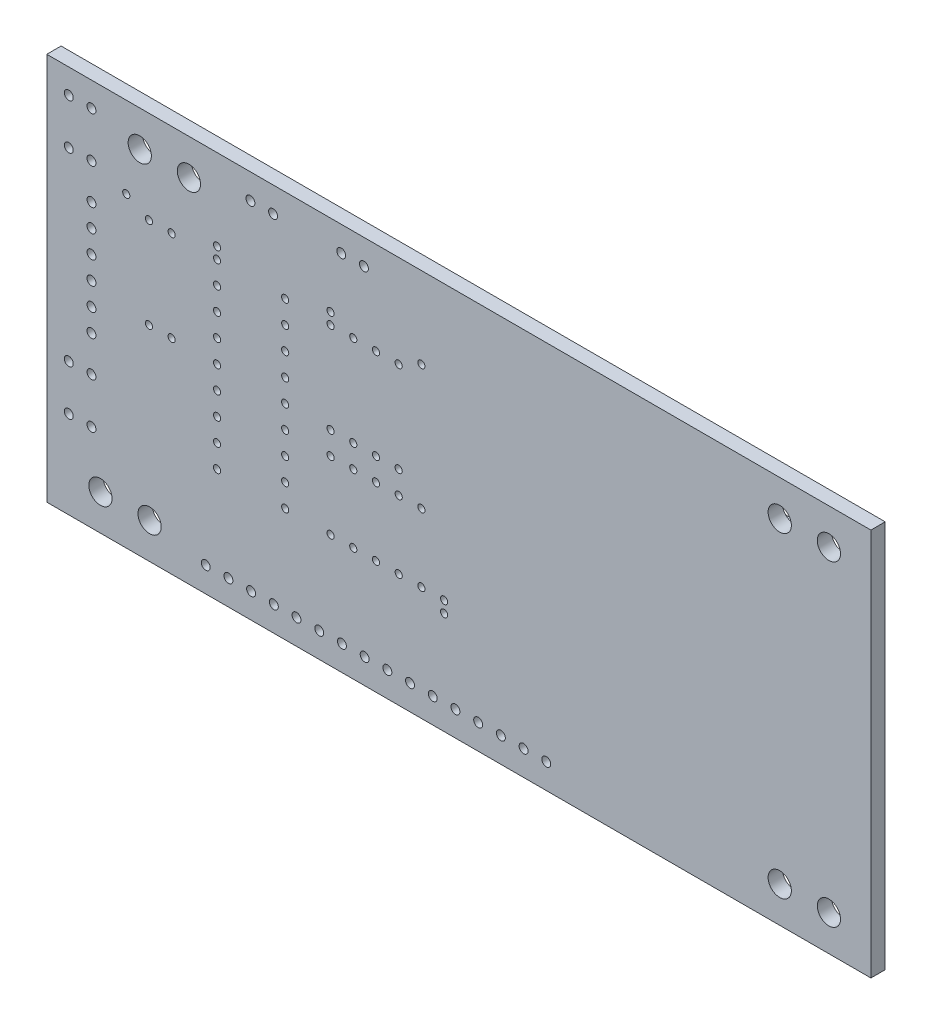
from build123d import *

# Parameters (mm, degrees)
ESQUISSE1_W             = 92.2
ESQUISSE1_H             = 43.4
ESQUISSE1_R             = 1.3
ESQUISSE1_R_2           = 0.5
ESQUISSE1_R_3           = 0.4
EXTRUSION1_DEPTH        = 1.6
EXTRUSION2_DEPTH        = 6.2
ESQUISSE3_R             = 9.8
ENL_V_MAT_EXTRU_1_DEPTH = 3.7
ESQUISSE4_W             = 24.163749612
ESQUISSE4_H             = 16
ENL_V_MAT_EXTRU_3_DEPTH = 1.5
ESQUISSE5_W             = 3.6
ESQUISSE5_H             = 0.8
ESQUISSE7_R             = 1.5
ENL_V_MAT_EXTRU_4_DEPTH = 1


with BuildPart() as part:
    # Esquisse1 → Extrusion1 (new body)
    with BuildSketch(Plane.XY):
        with Locations((46.1, 21.7)):
            Rectangle(ESQUISSE1_W, ESQUISSE1_H)
        with Locations((6, 4)):
            Circle(ESQUISSE1_R, mode=Mode.SUBTRACT)
        with Locations((11.5, 4)):
            Circle(ESQUISSE1_R, mode=Mode.SUBTRACT)
        with Locations((82, 4)):
            Circle(ESQUISSE1_R, mode=Mode.SUBTRACT)
        with Locations((87.5, 4)):
            Circle(ESQUISSE1_R, mode=Mode.SUBTRACT)
        with Locations((10.4, 39.4)):
            Circle(ESQUISSE1_R, mode=Mode.SUBTRACT)
        with Locations((15.9, 39.4)):
            Circle(ESQUISSE1_R, mode=Mode.SUBTRACT)
        with Locations(Location((82, 39.4, 0), (0, 0, 180))):
            Circle(ESQUISSE1_R, mode=Mode.SUBTRACT)
        with Locations(Location((87.5, 39.4, 0), (0, 0, 180))):
            Circle(ESQUISSE1_R, mode=Mode.SUBTRACT)
        with Locations((5, 40.663802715)):
            Circle(ESQUISSE1_R_2, mode=Mode.SUBTRACT)
        with Locations((5, 35.583802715)):
            Circle(ESQUISSE1_R_2, mode=Mode.SUBTRACT)
        with Locations((8.89, 34.313802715)):
            Circle(ESQUISSE1_R_3, mode=Mode.SUBTRACT)
        with Locations((13.97, 33.043802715)):
            Circle(ESQUISSE1_R_3, mode=Mode.SUBTRACT)
        with Locations((13.97, 22.883802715)):
            Circle(ESQUISSE1_R_3, mode=Mode.SUBTRACT)
        with Locations((11.43, 33.043802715)):
            Circle(ESQUISSE1_R_3, mode=Mode.SUBTRACT)
        with Locations((5, 21.423802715)):
            Circle(ESQUISSE1_R_2, mode=Mode.SUBTRACT)
        with Locations((5, 18.883802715)):
            Circle(ESQUISSE1_R_2, mode=Mode.SUBTRACT)
        with Locations((5, 14.883802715)):
            Circle(ESQUISSE1_R_2, mode=Mode.SUBTRACT)
        with Locations((5, 9.803802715)):
            Circle(ESQUISSE1_R_2, mode=Mode.SUBTRACT)
        with Locations((2.46, 9.803802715)):
            Circle(ESQUISSE1_R_2, mode=Mode.SUBTRACT)
        with Locations((2.46, 14.883802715)):
            Circle(ESQUISSE1_R_2, mode=Mode.SUBTRACT)
        with Locations((2.46, 35.583802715)):
            Circle(ESQUISSE1_R_2, mode=Mode.SUBTRACT)
        with Locations((2.46, 40.663802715)):
            Circle(ESQUISSE1_R_2, mode=Mode.SUBTRACT)
        with Locations((22.78, 40.6)):
            Circle(ESQUISSE1_R_2, mode=Mode.SUBTRACT)
        with Locations((25.32, 40.6)):
            Circle(ESQUISSE1_R_2, mode=Mode.SUBTRACT)
        with Locations((17.78, 2.8)):
            Circle(ESQUISSE1_R_2, mode=Mode.SUBTRACT)
        with Locations((20.32, 2.8)):
            Circle(ESQUISSE1_R_2, mode=Mode.SUBTRACT)
        with Locations((32.94, 40.6)):
            Circle(ESQUISSE1_R_2, mode=Mode.SUBTRACT)
        with Locations((35.48, 40.6)):
            Circle(ESQUISSE1_R_2, mode=Mode.SUBTRACT)
        with Locations((22.86, 2.8)):
            Circle(ESQUISSE1_R_2, mode=Mode.SUBTRACT)
        with Locations((25.4, 2.8)):
            Circle(ESQUISSE1_R_2, mode=Mode.SUBTRACT)
        with Locations((27.94, 2.8)):
            Circle(ESQUISSE1_R_2, mode=Mode.SUBTRACT)
        with Locations((30.48, 2.8)):
            Circle(ESQUISSE1_R_2, mode=Mode.SUBTRACT)
        with Locations((33.02, 2.8)):
            Circle(ESQUISSE1_R_2, mode=Mode.SUBTRACT)
        with Locations((35.56, 2.8)):
            Circle(ESQUISSE1_R_2, mode=Mode.SUBTRACT)
        with Locations((38.1, 2.8)):
            Circle(ESQUISSE1_R_2, mode=Mode.SUBTRACT)
        with Locations((40.64, 2.8)):
            Circle(ESQUISSE1_R_2, mode=Mode.SUBTRACT)
        with Locations((43.18, 2.8)):
            Circle(ESQUISSE1_R_2, mode=Mode.SUBTRACT)
        with Locations((45.72, 2.8)):
            Circle(ESQUISSE1_R_2, mode=Mode.SUBTRACT)
        with Locations((48.26, 2.8)):
            Circle(ESQUISSE1_R_2, mode=Mode.SUBTRACT)
        with Locations((50.8, 2.8)):
            Circle(ESQUISSE1_R_2, mode=Mode.SUBTRACT)
        with Locations((53.34, 2.8)):
            Circle(ESQUISSE1_R_2, mode=Mode.SUBTRACT)
        with Locations((55.88, 2.8)):
            Circle(ESQUISSE1_R_2, mode=Mode.SUBTRACT)
        with Locations((19.05, 34.313802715)):
            Circle(ESQUISSE1_R_3, mode=Mode.SUBTRACT)
        with Locations((19.05, 33.043802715)):
            Circle(ESQUISSE1_R_3, mode=Mode.SUBTRACT)
        with Locations((19.05, 30.503802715)):
            Circle(ESQUISSE1_R_3, mode=Mode.SUBTRACT)
        with Locations((19.05, 27.963802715)):
            Circle(ESQUISSE1_R_3, mode=Mode.SUBTRACT)
        with Locations((19.05, 25.423802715)):
            Circle(ESQUISSE1_R_3, mode=Mode.SUBTRACT)
        with Locations((19.05, 22.883802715)):
            Circle(ESQUISSE1_R_3, mode=Mode.SUBTRACT)
        with Locations((19.05, 20.343802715)):
            Circle(ESQUISSE1_R_3, mode=Mode.SUBTRACT)
        with Locations((19.05, 17.803802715)):
            Circle(ESQUISSE1_R_3, mode=Mode.SUBTRACT)
        with Locations((19.05, 15.263802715)):
            Circle(ESQUISSE1_R_3, mode=Mode.SUBTRACT)
        with Locations((19.05, 12.723802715)):
            Circle(ESQUISSE1_R_3, mode=Mode.SUBTRACT)
        with Locations((44.45, 11.453802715)):
            Circle(ESQUISSE1_R_3, mode=Mode.SUBTRACT)
        with Locations((11.43, 22.883802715)):
            Circle(ESQUISSE1_R_3, mode=Mode.SUBTRACT)
        with Locations((5, 23.963802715)):
            Circle(ESQUISSE1_R_2, mode=Mode.SUBTRACT)
        with Locations((5, 26.503802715)):
            Circle(ESQUISSE1_R_2, mode=Mode.SUBTRACT)
        with Locations((5, 29.043802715)):
            Circle(ESQUISSE1_R_2, mode=Mode.SUBTRACT)
        with Locations((5, 31.583802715)):
            Circle(ESQUISSE1_R_2, mode=Mode.SUBTRACT)
        with Locations((26.67, 33.043802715)):
            Circle(ESQUISSE1_R_3, mode=Mode.SUBTRACT)
        with Locations((26.67, 30.503802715)):
            Circle(ESQUISSE1_R_3, mode=Mode.SUBTRACT)
        with Locations((26.67, 27.963802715)):
            Circle(ESQUISSE1_R_3, mode=Mode.SUBTRACT)
        with Locations((26.67, 25.423802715)):
            Circle(ESQUISSE1_R_3, mode=Mode.SUBTRACT)
        with Locations((26.67, 22.883802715)):
            Circle(ESQUISSE1_R_3, mode=Mode.SUBTRACT)
        with Locations((26.67, 20.343802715)):
            Circle(ESQUISSE1_R_3, mode=Mode.SUBTRACT)
        with Locations((26.67, 17.803802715)):
            Circle(ESQUISSE1_R_3, mode=Mode.SUBTRACT)
        with Locations((26.67, 15.263802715)):
            Circle(ESQUISSE1_R_3, mode=Mode.SUBTRACT)
        with Locations((26.67, 12.723802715)):
            Circle(ESQUISSE1_R_3, mode=Mode.SUBTRACT)
        with Locations((31.75, 34.313802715)):
            Circle(ESQUISSE1_R_3, mode=Mode.SUBTRACT)
        with Locations((31.75, 33.043802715)):
            Circle(ESQUISSE1_R_3, mode=Mode.SUBTRACT)
        with Locations((31.75, 22.883802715)):
            Circle(ESQUISSE1_R_3, mode=Mode.SUBTRACT)
        with Locations((31.75, 20.343802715)):
            Circle(ESQUISSE1_R_3, mode=Mode.SUBTRACT)
        with Locations((31.75, 12.723802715)):
            Circle(ESQUISSE1_R_3, mode=Mode.SUBTRACT)
        with Locations((34.29, 33.043802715)):
            Circle(ESQUISSE1_R_3, mode=Mode.SUBTRACT)
        with Locations((34.29, 22.883802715)):
            Circle(ESQUISSE1_R_3, mode=Mode.SUBTRACT)
        with Locations((34.29, 20.343802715)):
            Circle(ESQUISSE1_R_3, mode=Mode.SUBTRACT)
        with Locations((34.29, 12.723802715)):
            Circle(ESQUISSE1_R_3, mode=Mode.SUBTRACT)
        with Locations((36.83, 33.043802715)):
            Circle(ESQUISSE1_R_3, mode=Mode.SUBTRACT)
        with Locations((36.83, 22.883802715)):
            Circle(ESQUISSE1_R_3, mode=Mode.SUBTRACT)
        with Locations((36.83, 20.343802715)):
            Circle(ESQUISSE1_R_3, mode=Mode.SUBTRACT)
        with Locations((36.83, 12.723802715)):
            Circle(ESQUISSE1_R_3, mode=Mode.SUBTRACT)
        with Locations((39.37, 33.043802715)):
            Circle(ESQUISSE1_R_3, mode=Mode.SUBTRACT)
        with Locations((39.37, 22.883802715)):
            Circle(ESQUISSE1_R_3, mode=Mode.SUBTRACT)
        with Locations((39.37, 20.343802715)):
            Circle(ESQUISSE1_R_3, mode=Mode.SUBTRACT)
        with Locations((39.37, 12.723802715)):
            Circle(ESQUISSE1_R_3, mode=Mode.SUBTRACT)
        with Locations((41.91, 34.313802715)):
            Circle(ESQUISSE1_R_3, mode=Mode.SUBTRACT)
        with Locations((41.91, 20.343802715)):
            Circle(ESQUISSE1_R_3, mode=Mode.SUBTRACT)
        with Locations((41.91, 12.723802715)):
            Circle(ESQUISSE1_R_3, mode=Mode.SUBTRACT)
        with Locations((44.45, 12.723802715)):
            Circle(ESQUISSE1_R_3, mode=Mode.SUBTRACT)
    extrude(amount=EXTRUSION1_DEPTH)

    # Esquisse2 → Extrusion2 (add)
    with BuildSketch(Plane(origin=(0, 0, 0), x_dir=(-1, 0, 0), z_dir=(0, 0, -1))):
        with BuildLine():
            Line((-76.05, 32.3), (-69.45, 32.3))
            Line((-69.45, 32.3), (-69.45, 26.611920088))
            ThreePointArc((-69.45, 26.611920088), (-72.75, 4.3), (-76.05, 26.611920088))
            Line((-76.05, 26.611920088), (-76.05, 32.3))
        make_face()
        with BuildLine():
            Line((-54.5, 28.1), (-45.5, 28.1))
            ThreePointArc((-45.5, 28.1), (-44.792893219, 27.807106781), (-44.5, 27.1))
            Line((-44.5, 27.1), (-44.5, 19.1))
            ThreePointArc((-44.5, 19.1), (-44.792893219, 18.392893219), (-45.5, 18.1))
            Line((-45.5, 18.1), (-54.5, 18.1))
            ThreePointArc((-54.5, 18.1), (-55.207106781, 18.392893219), (-55.5, 19.1))
            Line((-55.5, 19.1), (-55.5, 27.1))
            ThreePointArc((-55.5, 27.1), (-55.207106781, 27.807106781), (-54.5, 28.1))
        make_face()
    extrude(amount=EXTRUSION2_DEPTH)

    # Esquisse3 → Enl_v. mat.-Extru.1 (cut)
    with BuildSketch(Plane(origin=(0, 0, -6.2), x_dir=(-1, 0, 0), z_dir=(0, 0, -1))):
        with Locations((-72.75, 15.7)):
            Circle(ESQUISSE3_R)
    extrude(amount=-ENL_V_MAT_EXTRU_1_DEPTH, mode=Mode.SUBTRACT)

    # Esquisse4 → Enl_v. mat.-Extru.3 (cut)
    with BuildSketch(Plane(origin=(0, 0, -6.2), x_dir=(-1, 0, 0), z_dir=(0, 0, -1))):
        with Locations((-72.746262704, 12.3)):
            Rectangle(ESQUISSE4_W, ESQUISSE4_H)
    extrude(amount=-ENL_V_MAT_EXTRU_3_DEPTH, mode=Mode.SUBTRACT)

    # Balayage1: sweep along a path in Esquisse6
    with BuildLine(Plane(origin=(72.75, 0, 0), x_dir=(0, 0, -1), z_dir=(1, 0, 0))) as balayage1_path:
        Line((6.2, 29.4), (6.403526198, 29.4))
        ThreePointArc((6.403526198, 29.4), (6.68636891, 29.282842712), (6.803526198, 29))
        Line((6.803526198, 29), (6.803526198, 20.346283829))
        ThreePointArc((6.803526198, 20.346283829), (6.771637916, 19.782487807), (6.676379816, 19.22588318))
        Line((6.676379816, 19.22588318), (5.253749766, 13.038571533))
        ThreePointArc((5.253749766, 13.038571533), (5.132871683, 11.667883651), (5.390198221, 10.31615149))
        Line((5.390198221, 10.31615149), (5.618002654, 9.642642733))
    # Esquisse5 → Balayage1 (sweep)
    with BuildSketch(Plane(origin=(0, 0, -6.2), x_dir=(-1, 0, 0), z_dir=(0, 0, -1))):
        with Locations((-72.75, 29.4)):
            Rectangle(ESQUISSE5_W, ESQUISSE5_H)
    sweep(path=balayage1_path.line)

    # Esquisse7 → Enl_v. mat.-Extru.4 (cut)
    with BuildSketch(Plane(origin=(0, 0, -6.2), x_dir=(-1, 0, 0), z_dir=(0, 0, -1))):
        with Locations((-49.2, 23.1)):
            Circle(ESQUISSE7_R)
    extrude(amount=-ENL_V_MAT_EXTRU_4_DEPTH, mode=Mode.SUBTRACT)


solid = part.part
